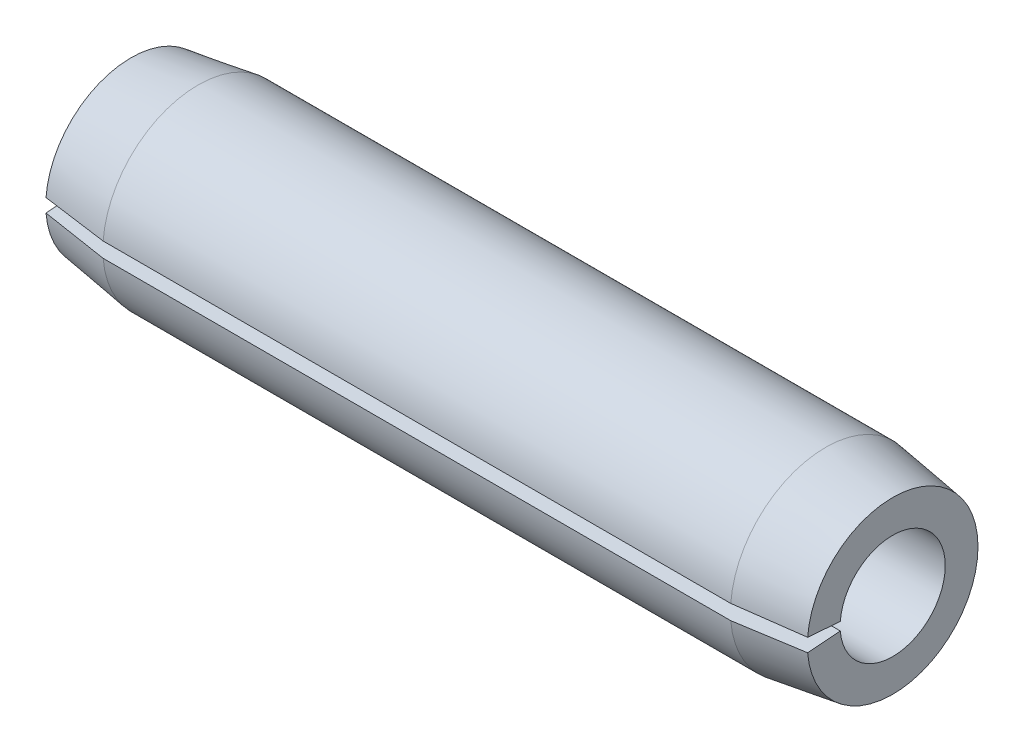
ISO-10303-21;
HEADER;
FILE_DESCRIPTION(('STEP AP214'),'2;1');
FILE_NAME('part.step','',(''),(''),'','','');
FILE_SCHEMA(('AUTOMOTIVE_DESIGN { 1 0 10303 214 1 1 1 1 }'));
ENDSEC;
DATA;
#1=APPLICATION_CONTEXT('core data for automotive mechanical design processes');
#2=APPLICATION_PROTOCOL_DEFINITION('international standard','automotive_design',2000,#1);
#3=PRODUCT_CONTEXT('',#1,'mechanical');
#4=PRODUCT('Part','Part','',(#3));
#5=PRODUCT_RELATED_PRODUCT_CATEGORY('part','',(#4));
#6=PRODUCT_DEFINITION_FORMATION('','',#4);
#7=PRODUCT_DEFINITION_CONTEXT('part definition',#1,'design');
#8=PRODUCT_DEFINITION('design','',#6,#7);
#9=PRODUCT_DEFINITION_SHAPE('','',#8);
#10=(LENGTH_UNIT() NAMED_UNIT(*) SI_UNIT(.MILLI.,.METRE.));
#11=(NAMED_UNIT(*) PLANE_ANGLE_UNIT() SI_UNIT($,.RADIAN.));
#12=(NAMED_UNIT(*) SI_UNIT($,.STERADIAN.) SOLID_ANGLE_UNIT());
#13=UNCERTAINTY_MEASURE_WITH_UNIT(LENGTH_MEASURE(1.E-05),#10,'distance_accuracy_value','');
#14=(GEOMETRIC_REPRESENTATION_CONTEXT(3) GLOBAL_UNCERTAINTY_ASSIGNED_CONTEXT((#13)) GLOBAL_UNIT_ASSIGNED_CONTEXT((#10,
#11,#12)) REPRESENTATION_CONTEXT('',''));
#15=CARTESIAN_POINT('',(0.,0.,0.));
#16=DIRECTION('',(0.,0.,1.));
#17=DIRECTION('',(1.,0.,0.));
#18=AXIS2_PLACEMENT_3D('',#15,#16,#17);
#19=CARTESIAN_POINT('',(0.,1.4224,0.));
#20=DIRECTION('',(1.,0.,0.));
#21=DIRECTION('',(0.,0.,-1.));
#22=AXIS2_PLACEMENT_3D('',#19,#20,#21);
#23=PLANE('',#22);
#24=DIRECTION('',(0.,0.0784590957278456,0.996917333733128));
#25=VECTOR('',#24,1.);
#26=CARTESIAN_POINT('',(0.,0.,0.));
#27=LINE('',#26,#25);
#28=CARTESIAN_POINT('',(0.,0.0687537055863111,0.87359865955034));
#29=VERTEX_POINT('',#28);
#30=CARTESIAN_POINT('',(0.,0.111600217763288,1.418015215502));
#31=VERTEX_POINT('',#30);
#32=EDGE_CURVE('E83',#29,#31,#27,.T.);
#33=ORIENTED_EDGE('',*,*,#32,.T.);
#34=CARTESIAN_POINT('',(0.,0.,0.));
#35=DIRECTION('',(-1.,0.,0.));
#36=DIRECTION('',(0.,0.,1.));
#37=AXIS2_PLACEMENT_3D('',#34,#35,#36);
#38=CIRCLE('',#37,1.4224);
#39=CARTESIAN_POINT('',(0.,-0.111600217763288,1.418015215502));
#40=VERTEX_POINT('',#39);
#41=EDGE_CURVE('E101',#31,#40,#38,.T.);
#42=ORIENTED_EDGE('',*,*,#41,.T.);
#43=DIRECTION('',(0.,-0.0784590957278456,0.996917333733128));
#44=VECTOR('',#43,1.);
#45=CARTESIAN_POINT('',(0.,0.,0.));
#46=LINE('',#45,#44);
#47=CARTESIAN_POINT('',(0.,-0.0687537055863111,0.87359865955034));
#48=VERTEX_POINT('',#47);
#49=EDGE_CURVE('E55',#48,#40,#46,.T.);
#50=ORIENTED_EDGE('',*,*,#49,.F.);
#51=CARTESIAN_POINT('',(0.,0.,0.));
#52=DIRECTION('',(-1.,0.,0.));
#53=DIRECTION('',(0.,0.,1.));
#54=AXIS2_PLACEMENT_3D('',#51,#52,#53);
#55=CIRCLE('',#54,0.8763);
#56=EDGE_CURVE('E98',#29,#48,#55,.T.);
#57=ORIENTED_EDGE('',*,*,#56,.F.);
#58=EDGE_LOOP('',(#33,#42,#50,#57));
#59=FACE_BOUND('',#58,.T.);
#60=ADVANCED_FACE('F34',(#59),#23,.F.);
#61=CARTESIAN_POINT('',(-9.52499999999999,0.,0.));
#62=DIRECTION('',(-1.,0.,0.));
#63=DIRECTION('',(0.,0.,1.));
#64=AXIS2_PLACEMENT_3D('',#61,#62,#63);
#65=CYLINDRICAL_SURFACE('',#64,0.8763);
#66=DIRECTION('',(-1.,0.,0.));
#67=VECTOR('',#66,1.);
#68=CARTESIAN_POINT('',(-9.52499999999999,0.0687537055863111,0.87359865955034));
#69=LINE('',#68,#67);
#70=CARTESIAN_POINT('',(12.7,0.0687537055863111,0.87359865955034));
#71=VERTEX_POINT('',#70);
#72=EDGE_CURVE('E86',#29,#71,#69,.F.);
#73=ORIENTED_EDGE('',*,*,#72,.F.);
#74=ORIENTED_EDGE('',*,*,#56,.T.);
#75=DIRECTION('',(-1.,0.,0.));
#76=VECTOR('',#75,1.);
#77=CARTESIAN_POINT('',(-9.52499999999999,-0.0687537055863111,0.87359865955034));
#78=LINE('',#77,#76);
#79=CARTESIAN_POINT('',(12.7,-0.0687537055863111,0.87359865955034));
#80=VERTEX_POINT('',#79);
#81=EDGE_CURVE('E119',#48,#80,#78,.F.);
#82=ORIENTED_EDGE('',*,*,#81,.T.);
#83=CARTESIAN_POINT('',(12.7,0.,0.));
#84=DIRECTION('',(-1.,0.,0.));
#85=DIRECTION('',(0.,0.,1.));
#86=AXIS2_PLACEMENT_3D('',#83,#84,#85);
#87=CIRCLE('',#86,0.8763);
#88=EDGE_CURVE('E100',#71,#80,#87,.T.);
#89=ORIENTED_EDGE('',*,*,#88,.F.);
#90=EDGE_LOOP('',(#73,#74,#82,#89));
#91=FACE_BOUND('',#90,.T.);
#92=ADVANCED_FACE('F96',(#91),#65,.F.);
#93=CARTESIAN_POINT('',(12.7,0.8763,0.));
#94=DIRECTION('',(-1.,0.,0.));
#95=DIRECTION('',(0.,0.,1.));
#96=AXIS2_PLACEMENT_3D('',#93,#94,#95);
#97=PLANE('',#96);
#98=DIRECTION('',(0.,0.0784590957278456,0.996917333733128));
#99=VECTOR('',#98,1.);
#100=CARTESIAN_POINT('',(12.7,0.,0.));
#101=LINE('',#100,#99);
#102=CARTESIAN_POINT('',(12.7,0.111600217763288,1.418015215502));
#103=VERTEX_POINT('',#102);
#104=EDGE_CURVE('E128',#71,#103,#101,.T.);
#105=ORIENTED_EDGE('',*,*,#104,.F.);
#106=ORIENTED_EDGE('',*,*,#88,.T.);
#107=DIRECTION('',(0.,-0.0784590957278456,0.996917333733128));
#108=VECTOR('',#107,1.);
#109=CARTESIAN_POINT('',(12.7,0.,0.));
#110=LINE('',#109,#108);
#111=CARTESIAN_POINT('',(12.7,-0.111600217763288,1.418015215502));
#112=VERTEX_POINT('',#111);
#113=EDGE_CURVE('E127',#80,#112,#110,.T.);
#114=ORIENTED_EDGE('',*,*,#113,.T.);
#115=CARTESIAN_POINT('',(12.7,0.,0.));
#116=DIRECTION('',(-1.,0.,0.));
#117=DIRECTION('',(0.,0.,1.));
#118=AXIS2_PLACEMENT_3D('',#115,#116,#117);
#119=CIRCLE('',#118,1.4224);
#120=EDGE_CURVE('E105',#103,#112,#119,.T.);
#121=ORIENTED_EDGE('',*,*,#120,.F.);
#122=EDGE_LOOP('',(#105,#106,#114,#121));
#123=FACE_BOUND('',#122,.T.);
#124=ADVANCED_FACE('F138',(#123),#97,.F.);
#125=CARTESIAN_POINT('',(12.7,0.,0.));
#126=DIRECTION('',(-1.,0.,0.));
#127=DIRECTION('',(0.,0.,1.));
#128=AXIS2_PLACEMENT_3D('',#125,#126,#127);
#129=CONICAL_SURFACE('',#128,1.4224,0.146666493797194);
#130=DIRECTION('',(-0.989263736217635,0.0114661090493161,0.145690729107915));
#131=VECTOR('',#130,1.);
#132=CARTESIAN_POINT('',(22.3285538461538,0.,0.));
#133=LINE('',#132,#131);
#134=CARTESIAN_POINT('',(11.5824,0.124553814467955,1.58260626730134));
#135=VERTEX_POINT('',#134);
#136=EDGE_CURVE('E102',#103,#135,#133,.T.);
#137=ORIENTED_EDGE('',*,*,#136,.F.);
#138=ORIENTED_EDGE('',*,*,#120,.T.);
#139=DIRECTION('',(-0.989263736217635,-0.0114661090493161,0.145690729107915));
#140=VECTOR('',#139,1.);
#141=CARTESIAN_POINT('',(22.3285538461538,0.,0.));
#142=LINE('',#141,#140);
#143=CARTESIAN_POINT('',(11.5824,-0.124553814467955,1.58260626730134));
#144=VERTEX_POINT('',#143);
#145=EDGE_CURVE('E121',#112,#144,#142,.T.);
#146=ORIENTED_EDGE('',*,*,#145,.T.);
#147=CARTESIAN_POINT('',(11.5824,0.,0.));
#148=DIRECTION('',(-1.,0.,0.));
#149=DIRECTION('',(0.,0.,1.));
#150=AXIS2_PLACEMENT_3D('',#147,#148,#149);
#151=CIRCLE('',#150,1.5875);
#152=EDGE_CURVE('E110',#135,#144,#151,.T.);
#153=ORIENTED_EDGE('',*,*,#152,.F.);
#154=EDGE_LOOP('',(#137,#138,#146,#153));
#155=FACE_BOUND('',#154,.T.);
#156=ADVANCED_FACE('F137',(#155),#129,.T.);
#157=CARTESIAN_POINT('',(-9.52499999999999,0.,0.));
#158=DIRECTION('',(-1.,0.,0.));
#159=DIRECTION('',(0.,0.,1.));
#160=AXIS2_PLACEMENT_3D('',#157,#158,#159);
#161=CYLINDRICAL_SURFACE('',#160,1.5875);
#162=DIRECTION('',(-1.,0.,0.));
#163=VECTOR('',#162,1.);
#164=CARTESIAN_POINT('',(-9.52499999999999,0.124553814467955,1.58260626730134));
#165=LINE('',#164,#163);
#166=CARTESIAN_POINT('',(1.1176,0.124553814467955,1.58260626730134));
#167=VERTEX_POINT('',#166);
#168=EDGE_CURVE('E47',#135,#167,#165,.T.);
#169=ORIENTED_EDGE('',*,*,#168,.F.);
#170=ORIENTED_EDGE('',*,*,#152,.T.);
#171=DIRECTION('',(-1.,0.,0.));
#172=VECTOR('',#171,1.);
#173=CARTESIAN_POINT('',(-9.52499999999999,-0.124553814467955,1.58260626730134));
#174=LINE('',#173,#172);
#175=CARTESIAN_POINT('',(1.1176,-0.124553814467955,1.58260626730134));
#176=VERTEX_POINT('',#175);
#177=EDGE_CURVE('E124',#144,#176,#174,.T.);
#178=ORIENTED_EDGE('',*,*,#177,.T.);
#179=CARTESIAN_POINT('',(1.1176,0.,0.));
#180=DIRECTION('',(-1.,0.,0.));
#181=DIRECTION('',(0.,0.,1.));
#182=AXIS2_PLACEMENT_3D('',#179,#180,#181);
#183=CIRCLE('',#182,1.5875);
#184=EDGE_CURVE('E113',#167,#176,#183,.T.);
#185=ORIENTED_EDGE('',*,*,#184,.F.);
#186=EDGE_LOOP('',(#169,#170,#178,#185));
#187=FACE_BOUND('',#186,.T.);
#188=ADVANCED_FACE('F141',(#187),#161,.T.);
#189=CARTESIAN_POINT('',(1.1176,0.,0.));
#190=DIRECTION('',(1.,0.,0.));
#191=DIRECTION('',(0.,0.,-1.));
#192=AXIS2_PLACEMENT_3D('',#189,#190,#191);
#193=CONICAL_SURFACE('',#192,1.5875,0.146666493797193);
#194=DIRECTION('',(-0.989263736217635,-0.011466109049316,-0.145690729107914));
#195=VECTOR('',#194,1.);
#196=CARTESIAN_POINT('',(-9.62855384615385,0.,0.));
#197=LINE('',#196,#195);
#198=EDGE_CURVE('E11',#167,#31,#197,.T.);
#199=ORIENTED_EDGE('',*,*,#198,.F.);
#200=ORIENTED_EDGE('',*,*,#184,.T.);
#201=DIRECTION('',(-0.989263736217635,0.011466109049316,-0.145690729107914));
#202=VECTOR('',#201,1.);
#203=CARTESIAN_POINT('',(-9.62855384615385,0.,0.));
#204=LINE('',#203,#202);
#205=EDGE_CURVE('E41',#176,#40,#204,.T.);
#206=ORIENTED_EDGE('',*,*,#205,.T.);
#207=ORIENTED_EDGE('',*,*,#41,.F.);
#208=EDGE_LOOP('',(#199,#200,#206,#207));
#209=FACE_BOUND('',#208,.T.);
#210=ADVANCED_FACE('F144',(#209),#193,.T.);
#211=CARTESIAN_POINT('',(12.7,0.,0.));
#212=DIRECTION('',(0.,-0.996917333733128,-0.0784590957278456));
#213=DIRECTION('',(0.,0.0784590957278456,-0.996917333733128));
#214=AXIS2_PLACEMENT_3D('',#211,#212,#213);
#215=PLANE('',#214);
#216=ORIENTED_EDGE('',*,*,#49,.T.);
#217=ORIENTED_EDGE('',*,*,#205,.F.);
#218=ORIENTED_EDGE('',*,*,#177,.F.);
#219=ORIENTED_EDGE('',*,*,#145,.F.);
#220=ORIENTED_EDGE('',*,*,#113,.F.);
#221=ORIENTED_EDGE('',*,*,#81,.F.);
#222=EDGE_LOOP('',(#216,#217,#218,#219,#220,#221));
#223=FACE_BOUND('',#222,.T.);
#224=ADVANCED_FACE('F139',(#223),#215,.F.);
#225=CARTESIAN_POINT('',(12.7,0.,0.));
#226=DIRECTION('',(0.,-0.996917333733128,0.0784590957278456));
#227=DIRECTION('',(0.,-0.0784590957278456,-0.996917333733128));
#228=AXIS2_PLACEMENT_3D('',#225,#226,#227);
#229=PLANE('',#228);
#230=ORIENTED_EDGE('',*,*,#72,.T.);
#231=ORIENTED_EDGE('',*,*,#104,.T.);
#232=ORIENTED_EDGE('',*,*,#136,.T.);
#233=ORIENTED_EDGE('',*,*,#168,.T.);
#234=ORIENTED_EDGE('',*,*,#198,.T.);
#235=ORIENTED_EDGE('',*,*,#32,.F.);
#236=EDGE_LOOP('',(#230,#231,#232,#233,#234,#235));
#237=FACE_BOUND('',#236,.T.);
#238=ADVANCED_FACE('F85',(#237),#229,.T.);
#239=CLOSED_SHELL('',(#60,#92,#124,#156,#188,#210,#224,#238));
#240=MANIFOLD_SOLID_BREP('B2',#239);
#241=ADVANCED_BREP_SHAPE_REPRESENTATION('',(#18,#240),#14);
#242=SHAPE_DEFINITION_REPRESENTATION(#9,#241);
ENDSEC;
END-ISO-10303-21;
